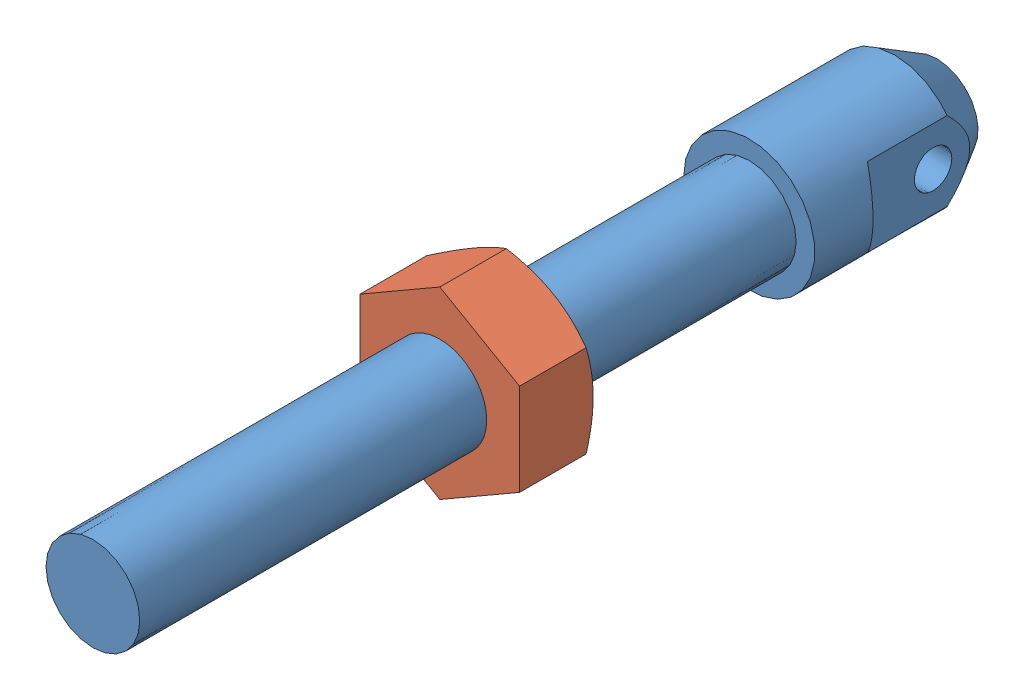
SolidWorks assembly CBS2-40-L.sldasm, configuration Default (file format 15000). Lengths in mm.
Overall size (17 19.63 90).
2 component instances, 2 part files, 0 mates.
Components (placement in the parent):
- CBS2-40-L_01-1: CBS2-40-L_01.sldprt [ﾃﾞﾌｫﾙﾄ] at (0 0 14) x (-1 0 0) z (0 0 -1) size (14 14 90)
- CBS2-40-L_02-1: CBS2-40-L_02.sldprt [ﾃﾞﾌｫﾙﾄ] at (0 0 47) x (-1 0 0) z (0 0 -1) size (17 19.63 8)
